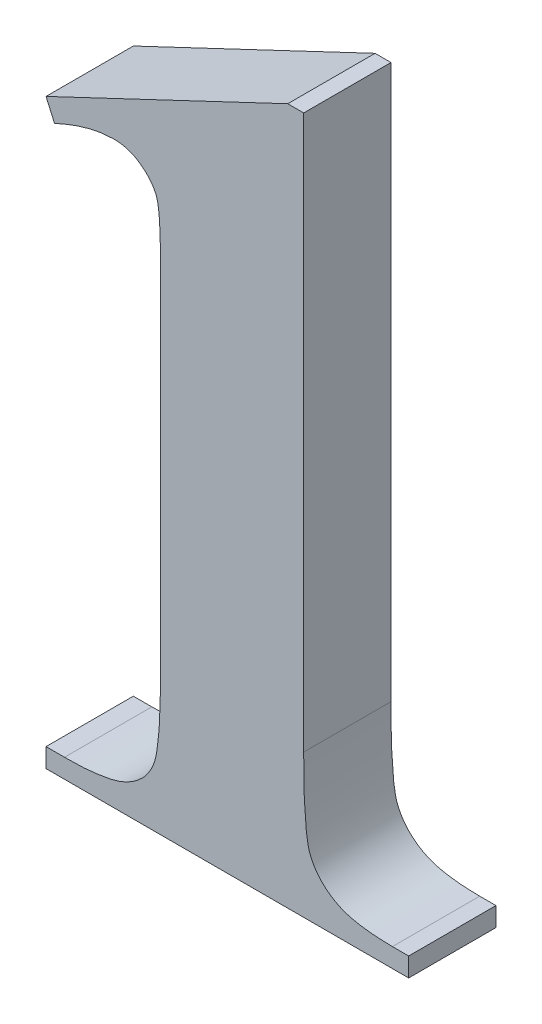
from build123d import *

# Parameters (mm, degrees)
SKETCH2_W          = 57.15
SKETCH2_H          = 57.15
BASE_EXTRUDE_DEPTH = 6.35
SKETCH4_OUTSIDE_W  = 75.364
SKETCH4_OUTSIDE_H  = 75.364
CUT_EXTRUDE1_DEPTH = 65.210401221


with BuildPart() as part:
    # Sketch2 → Base-Extrude (new body)
    with BuildSketch(Plane.XY):
        with Locations((0, 28.575)):
            Rectangle(SKETCH2_W, SKETCH2_H)
    extrude(amount=-BASE_EXTRUDE_DEPTH)

    # Sketch4 outside → Cut-Extrude1 (cut, through all)
    with BuildSketch(Plane.XY):
        with Locations((0, 28.575)):
            Rectangle(SKETCH4_OUTSIDE_W, SKETCH4_OUTSIDE_H)
        with BuildLine():
            Line((-4.281332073, 50.669650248), (-4.281332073, 10.411571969))
            add(Edge.make_bspline(
                [(-4.281332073, 10.411571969), (-4.277307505, 10.035602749), (-4.269606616, 9.316196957), (-4.265049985, 8.292878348), (-4.234568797, 7.374085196), (-4.175304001, 6.564864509), (-4.124638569, 5.859360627), (-4.065419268, 5.260927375), (-3.978461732, 4.77245875), (-3.855614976, 4.26525746), (-3.61319163, 3.731088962), (-3.229134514, 3.154679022), (-2.721599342, 2.645231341), (-2.097113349, 2.183802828), (-1.303214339, 1.807262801), (-0.313589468, 1.562094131), (0.865849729, 1.416300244), (1.715671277, 1.398019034), (2.17167347, 1.388209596)],
                knots=[0, 0, 0, 0, 1.355603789, 2.59390707, 3.68946524, 4.66918887, 5.518904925, 6.240030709, 6.835759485, 7.306792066, 8.118050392, 8.935047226, 9.792227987, 10.696851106, 11.722904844, 12.936961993, 14.356417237, 16, 16, 16, 16], degree=3))
            Line((2.17167347, 1.388209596), (3.353820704, 1.388209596))
            Line((3.353820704, 1.388209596), (3.353820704, 0))
            Line((3.353820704, 0), (-23.022161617, 0))
            Line((-23.022161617, 0), (-23.022161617, 1.388209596))
            Line((-23.022161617, 1.388209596), (-21.677333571, 1.388209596))
            add(Edge.make_bspline(
                [(-21.677333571, 1.388209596), (-21.174124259, 1.392131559), (-20.240911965, 1.399404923), (-18.962153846, 1.559618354), (-17.902500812, 1.759932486), (-17.068239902, 2.10600014), (-16.415011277, 2.539197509), (-15.874586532, 3.020358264), (-15.466065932, 3.595601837), (-15.201073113, 4.133960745), (-15.045660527, 4.650654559), (-14.951991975, 5.152324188), (-14.884641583, 5.76212194), (-14.802105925, 6.476771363), (-14.751700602, 7.305595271), (-14.723125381, 8.242326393), (-14.700444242, 9.29078479), (-14.695506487, 10.024740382), (-14.692904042, 10.411571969)],
                knots=[0, 0, 0, 0, 1.747462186, 3.240705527, 4.475612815, 5.483832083, 6.355187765, 7.191212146, 7.982999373, 8.792342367, 9.265382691, 9.854400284, 10.563599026, 11.39763771, 12.354753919, 13.448686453, 14.655329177, 16, 16, 16, 16], degree=3))
            Line((-14.692904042, 10.411571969), (-14.692904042, 36.093449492))
            add(Edge.make_bspline(
                [(-14.692904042, 36.093449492), (-14.697122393, 36.581534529), (-14.704656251, 37.453240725), (-14.752999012, 38.611840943), (-14.835310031, 39.469643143), (-15.005623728, 40.223497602), (-15.438913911, 40.922847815), (-16.035911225, 41.438071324), (-16.592504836, 41.805749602), (-17.077207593, 41.978560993), (-17.58138682, 42.112535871), (-17.931092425, 42.119790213), (-18.109201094, 42.123484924)],
                knots=[0, 0, 0, 0, 1.840789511, 3.287598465, 4.371650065, 5.089217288, 6.183508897, 7.399611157, 8.042724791, 8.685838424, 9.330683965, 10, 10, 10, 10], degree=3))
            add(Edge.make_bspline(
                [(-18.109201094, 42.123484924), (-18.421159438, 42.106540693), (-19.080578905, 42.070723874), (-20.11291693, 41.834095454), (-21.23732981, 41.465393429), (-22.001798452, 41.129101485), (-22.403974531, 40.952183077)],
                knots=[0, 0, 0, 0, 0.835144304, 1.765333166, 2.824373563, 4, 4, 4, 4], degree=3))
            Line((-22.403974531, 40.952183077), (-23.022161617, 42.340392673))
            Line((-23.022161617, 42.340392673), (-5.441788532, 50.669650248))
            Line((-5.441788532, 50.669650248), (-4.281332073, 50.669650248))
        make_face(mode=Mode.SUBTRACT)
    extrude(amount=-CUT_EXTRUDE1_DEPTH, mode=Mode.SUBTRACT)


solid = part.part
